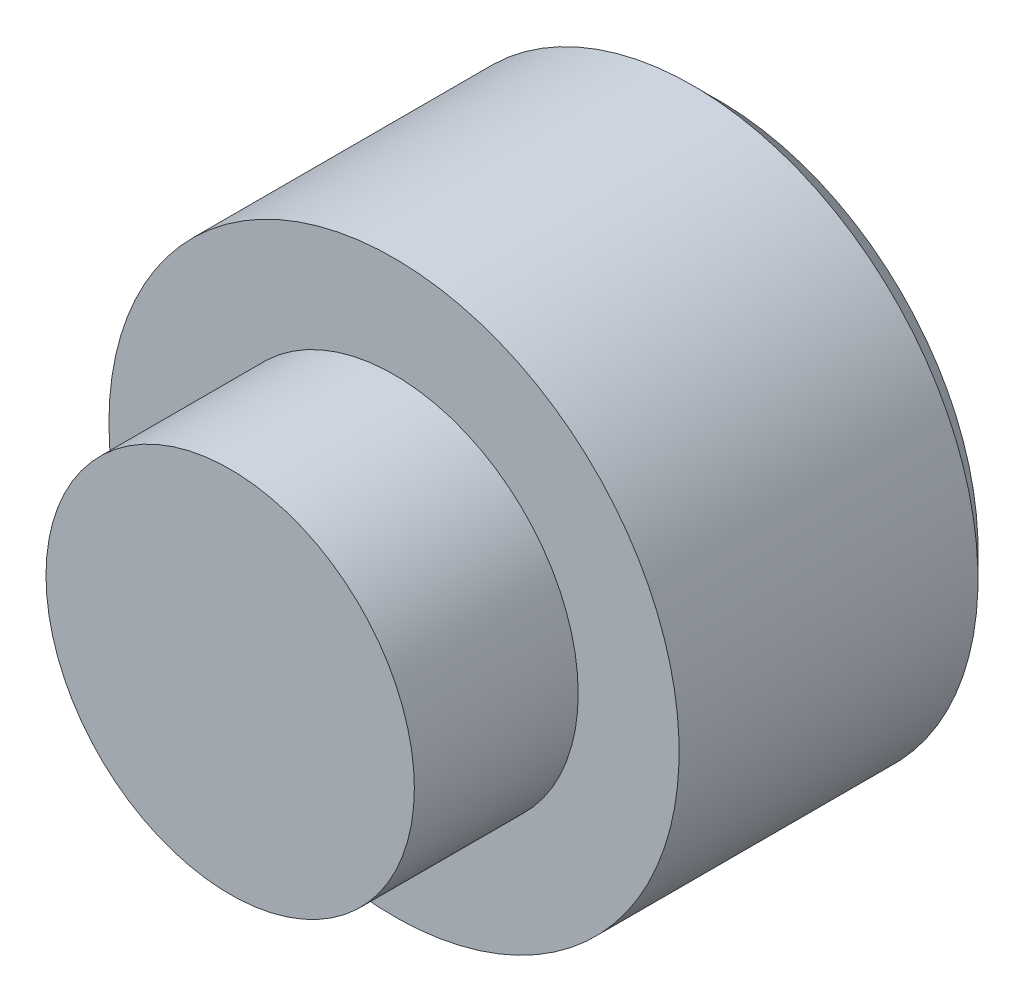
from build123d import *

# Parameters (mm, degrees)
SKETCH1_R           = 3.5687
BOSS_EXTRUDE1_DEPTH = 3.175
SKETCH2_R           = 5.5245
BOSS_EXTRUDE2_DEPTH = 6.2992
CHAMFER1_SIZE       = 0.508


with BuildPart() as part:
    # Sketch1 → Boss-Extrude1 (new body)
    with BuildSketch(Plane.XY):
        Circle(SKETCH1_R)
    extrude(amount=BOSS_EXTRUDE1_DEPTH)

    # Sketch2 → Boss-Extrude2 (add)
    with BuildSketch(Plane(origin=(0, 0, 0), x_dir=(-1, 0, 0), z_dir=(0, 0, -1))):
        Circle(SKETCH2_R)
    extrude(amount=BOSS_EXTRUDE2_DEPTH)

    # Chamfer1
    chamfer1_edges = [part.edges().sort_by_distance(p)[0] for p in [
        (5.5245, 0, -6.2992),
    ]]
    chamfer(chamfer1_edges, length=CHAMFER1_SIZE)


solid = part.part
